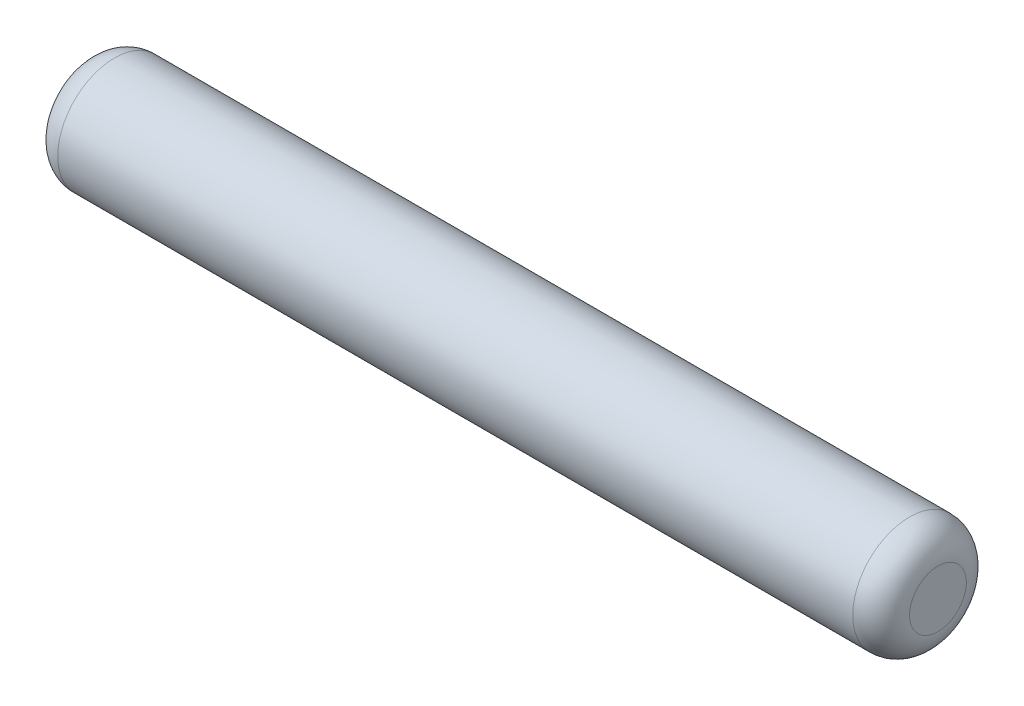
ISO-10303-21;
HEADER;
FILE_DESCRIPTION(('STEP AP214'),'2;1');
FILE_NAME('part.step','',(''),(''),'','','');
FILE_SCHEMA(('AUTOMOTIVE_DESIGN { 1 0 10303 214 1 1 1 1 }'));
ENDSEC;
DATA;
#1=APPLICATION_CONTEXT('core data for automotive mechanical design processes');
#2=APPLICATION_PROTOCOL_DEFINITION('international standard','automotive_design',2000,#1);
#3=PRODUCT_CONTEXT('',#1,'mechanical');
#4=PRODUCT('Part','Part','',(#3));
#5=PRODUCT_RELATED_PRODUCT_CATEGORY('part','',(#4));
#6=PRODUCT_DEFINITION_FORMATION('','',#4);
#7=PRODUCT_DEFINITION_CONTEXT('part definition',#1,'design');
#8=PRODUCT_DEFINITION('design','',#6,#7);
#9=PRODUCT_DEFINITION_SHAPE('','',#8);
#10=(LENGTH_UNIT() NAMED_UNIT(*) SI_UNIT(.MILLI.,.METRE.));
#11=(NAMED_UNIT(*) PLANE_ANGLE_UNIT() SI_UNIT($,.RADIAN.));
#12=(NAMED_UNIT(*) SI_UNIT($,.STERADIAN.) SOLID_ANGLE_UNIT());
#13=UNCERTAINTY_MEASURE_WITH_UNIT(LENGTH_MEASURE(1.E-05),#10,'distance_accuracy_value','');
#14=(GEOMETRIC_REPRESENTATION_CONTEXT(3) GLOBAL_UNCERTAINTY_ASSIGNED_CONTEXT((#13)) GLOBAL_UNIT_ASSIGNED_CONTEXT((#10,
#11,#12)) REPRESENTATION_CONTEXT('',''));
#15=CARTESIAN_POINT('',(0.,0.,0.));
#16=DIRECTION('',(0.,0.,1.));
#17=DIRECTION('',(1.,0.,0.));
#18=AXIS2_PLACEMENT_3D('',#15,#16,#17);
#19=CARTESIAN_POINT('',(0.,0.,0.));
#20=DIRECTION('',(1.,0.,0.));
#21=DIRECTION('',(0.,0.,-1.));
#22=AXIS2_PLACEMENT_3D('',#19,#20,#21);
#23=PLANE('',#22);
#24=CARTESIAN_POINT('',(0.,0.,0.));
#25=DIRECTION('',(1.,0.,0.));
#26=DIRECTION('',(0.,0.,-1.));
#27=AXIS2_PLACEMENT_3D('',#24,#25,#26);
#28=CIRCLE('',#27,2.);
#29=CARTESIAN_POINT('',(0.,0.,-2.));
#30=VERTEX_POINT('',#29);
#31=EDGE_CURVE('E29',#30,#30,#28,.F.);
#32=ORIENTED_EDGE('',*,*,#31,.T.);
#33=EDGE_LOOP('',(#32));
#34=FACE_BOUND('',#33,.T.);
#35=ADVANCED_FACE('F14',(#34),#23,.F.);
#36=CARTESIAN_POINT('',(0.,0.,0.));
#37=DIRECTION('',(-1.,0.,0.));
#38=DIRECTION('',(0.,0.,1.));
#39=AXIS2_PLACEMENT_3D('',#36,#37,#38);
#40=CYLINDRICAL_SURFACE('',#39,4.);
#41=CARTESIAN_POINT('',(2.,0.,0.));
#42=DIRECTION('',(1.,0.,0.));
#43=DIRECTION('',(0.,0.,-1.));
#44=AXIS2_PLACEMENT_3D('',#41,#42,#43);
#45=CIRCLE('',#44,4.);
#46=CARTESIAN_POINT('',(2.,0.,-4.));
#47=VERTEX_POINT('',#46);
#48=EDGE_CURVE('E21',#47,#47,#45,.T.);
#49=ORIENTED_EDGE('',*,*,#48,.T.);
#50=EDGE_LOOP('',(#49));
#51=FACE_BOUND('',#50,.T.);
#52=CARTESIAN_POINT('',(58.,0.,0.));
#53=DIRECTION('',(-1.,0.,0.));
#54=DIRECTION('',(0.,0.,1.));
#55=AXIS2_PLACEMENT_3D('',#52,#53,#54);
#56=CIRCLE('',#55,4.);
#57=CARTESIAN_POINT('',(58.,0.,4.));
#58=VERTEX_POINT('',#57);
#59=EDGE_CURVE('E25',#58,#58,#56,.T.);
#60=ORIENTED_EDGE('',*,*,#59,.T.);
#61=EDGE_LOOP('',(#60));
#62=FACE_BOUND('',#61,.T.);
#63=ADVANCED_FACE('F47',(#51,#62),#40,.T.);
#64=CARTESIAN_POINT('',(60.,4.,0.));
#65=DIRECTION('',(-1.,0.,0.));
#66=DIRECTION('',(0.,0.,1.));
#67=AXIS2_PLACEMENT_3D('',#64,#65,#66);
#68=PLANE('',#67);
#69=CARTESIAN_POINT('',(60.,0.,0.));
#70=DIRECTION('',(-1.,0.,0.));
#71=DIRECTION('',(0.,0.,1.));
#72=AXIS2_PLACEMENT_3D('',#69,#70,#71);
#73=CIRCLE('',#72,2.);
#74=CARTESIAN_POINT('',(60.,0.,2.));
#75=VERTEX_POINT('',#74);
#76=EDGE_CURVE('E9',#75,#75,#73,.F.);
#77=ORIENTED_EDGE('',*,*,#76,.T.);
#78=EDGE_LOOP('',(#77));
#79=FACE_BOUND('',#78,.T.);
#80=ADVANCED_FACE('F38',(#79),#68,.F.);
#81=CARTESIAN_POINT('',(2.,0.,0.));
#82=DIRECTION('',(1.,0.,0.));
#83=DIRECTION('',(0.,0.,-1.));
#84=AXIS2_PLACEMENT_3D('',#81,#82,#83);
#85=DEGENERATE_TOROIDAL_SURFACE('',#84,2.,2.,.T.);
#86=ORIENTED_EDGE('',*,*,#48,.F.);
#87=EDGE_LOOP('',(#86));
#88=FACE_BOUND('',#87,.T.);
#89=ORIENTED_EDGE('',*,*,#31,.F.);
#90=EDGE_LOOP('',(#89));
#91=FACE_BOUND('',#90,.T.);
#92=ADVANCED_FACE('F36',(#88,#91),#85,.T.);
#93=CARTESIAN_POINT('',(58.,0.,0.));
#94=DIRECTION('',(-1.,0.,0.));
#95=DIRECTION('',(0.,0.,1.));
#96=AXIS2_PLACEMENT_3D('',#93,#94,#95);
#97=DEGENERATE_TOROIDAL_SURFACE('',#96,2.,2.,.T.);
#98=ORIENTED_EDGE('',*,*,#76,.F.);
#99=EDGE_LOOP('',(#98));
#100=FACE_BOUND('',#99,.T.);
#101=ORIENTED_EDGE('',*,*,#59,.F.);
#102=EDGE_LOOP('',(#101));
#103=FACE_BOUND('',#102,.T.);
#104=ADVANCED_FACE('F16',(#100,#103),#97,.T.);
#105=CLOSED_SHELL('',(#35,#63,#80,#92,#104));
#106=MANIFOLD_SOLID_BREP('B1',#105);
#107=ADVANCED_BREP_SHAPE_REPRESENTATION('',(#18,#106),#14);
#108=SHAPE_DEFINITION_REPRESENTATION(#9,#107);
ENDSEC;
END-ISO-10303-21;
